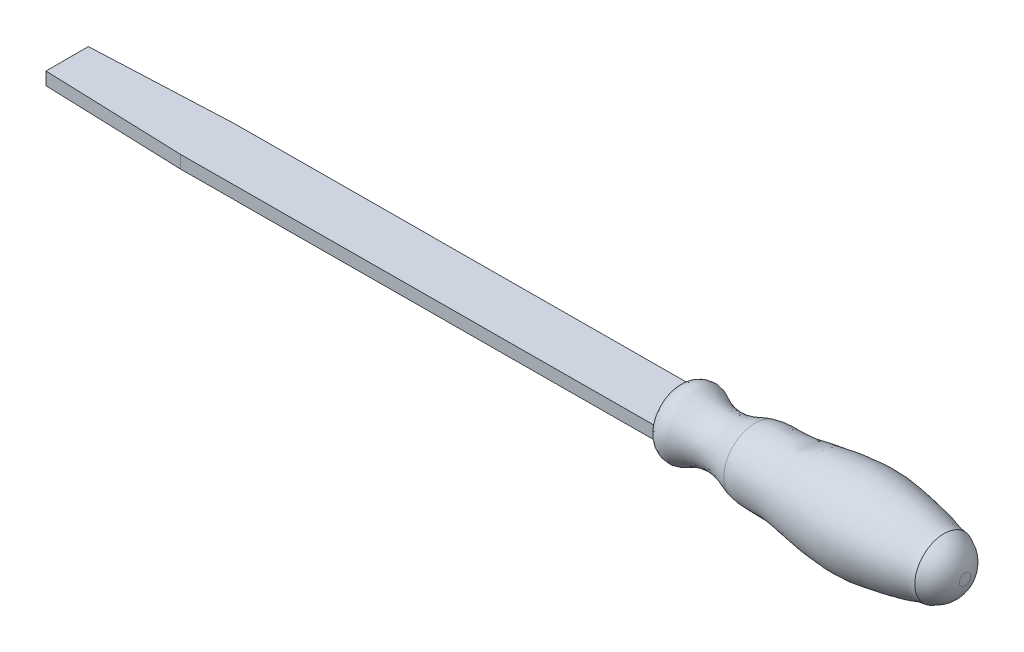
ISO-10303-21;
HEADER;
FILE_DESCRIPTION(('STEP AP214'),'2;1');
FILE_NAME('part.step','',(''),(''),'','','');
FILE_SCHEMA(('AUTOMOTIVE_DESIGN { 1 0 10303 214 1 1 1 1 }'));
ENDSEC;
DATA;
#1=APPLICATION_CONTEXT('core data for automotive mechanical design processes');
#2=APPLICATION_PROTOCOL_DEFINITION('international standard','automotive_design',2000,#1);
#3=PRODUCT_CONTEXT('',#1,'mechanical');
#4=PRODUCT('Part','Part','',(#3));
#5=PRODUCT_RELATED_PRODUCT_CATEGORY('part','',(#4));
#6=PRODUCT_DEFINITION_FORMATION('','',#4);
#7=PRODUCT_DEFINITION_CONTEXT('part definition',#1,'design');
#8=PRODUCT_DEFINITION('design','',#6,#7);
#9=PRODUCT_DEFINITION_SHAPE('','',#8);
#10=(LENGTH_UNIT() NAMED_UNIT(*) SI_UNIT(.MILLI.,.METRE.));
#11=(NAMED_UNIT(*) PLANE_ANGLE_UNIT() SI_UNIT($,.RADIAN.));
#12=(NAMED_UNIT(*) SI_UNIT($,.STERADIAN.) SOLID_ANGLE_UNIT());
#13=UNCERTAINTY_MEASURE_WITH_UNIT(LENGTH_MEASURE(1.E-05),#10,'distance_accuracy_value','');
#14=(GEOMETRIC_REPRESENTATION_CONTEXT(3) GLOBAL_UNCERTAINTY_ASSIGNED_CONTEXT((#13)) GLOBAL_UNIT_ASSIGNED_CONTEXT((#10,
#11,#12)) REPRESENTATION_CONTEXT('',''));
#15=CARTESIAN_POINT('',(0.,0.,0.));
#16=DIRECTION('',(0.,0.,1.));
#17=DIRECTION('',(1.,0.,0.));
#18=AXIS2_PLACEMENT_3D('',#15,#16,#17);
#19=CARTESIAN_POINT('',(-240.001553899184,-3.65954191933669,10.5));
#20=DIRECTION('',(0.00483121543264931,-0.999988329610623,0.));
#21=DIRECTION('',(0.999988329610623,0.00483121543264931,0.));
#22=AXIS2_PLACEMENT_3D('',#19,#20,#21);
#23=PLANE('',#22);
#24=DIRECTION('',(0.999988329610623,0.00483121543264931,0.));
#25=VECTOR('',#24,1.);
#26=CARTESIAN_POINT('',(-240.001553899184,-3.65954191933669,10.5));
#27=LINE('',#26,#25);
#28=CARTESIAN_POINT('',(-185.002195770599,-3.39382507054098,10.5));
#29=VERTEX_POINT('',#28);
#30=CARTESIAN_POINT('',(0.489100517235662,-2.49766619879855,10.5));
#31=VERTEX_POINT('',#30);
#32=EDGE_CURVE('E134',#29,#31,#27,.T.);
#33=ORIENTED_EDGE('',*,*,#32,.F.);
#34=DIRECTION('',(-0.999189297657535,-0.0048273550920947,-0.0399680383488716));
#35=VECTOR('',#34,1.);
#36=CARTESIAN_POINT('',(-239.913695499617,-3.65911745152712,8.30351437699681));
#37=LINE('',#36,#35);
#38=CARTESIAN_POINT('',(-240.001553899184,-3.65954191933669,8.3));
#39=VERTEX_POINT('',#38);
#40=EDGE_CURVE('E112',#29,#39,#37,.T.);
#41=ORIENTED_EDGE('',*,*,#40,.T.);
#42=DIRECTION('',(0.,0.,-1.));
#43=VECTOR('',#42,1.);
#44=CARTESIAN_POINT('',(-240.001553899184,-3.65954191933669,10.5));
#45=LINE('',#44,#43);
#46=CARTESIAN_POINT('',(-240.001553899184,-3.65954191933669,-8.29999999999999));
#47=VERTEX_POINT('',#46);
#48=EDGE_CURVE('E62',#39,#47,#45,.T.);
#49=ORIENTED_EDGE('',*,*,#48,.T.);
#50=DIRECTION('',(-0.999189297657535,-0.0048273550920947,0.0399680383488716));
#51=VECTOR('',#50,1.);
#52=CARTESIAN_POINT('',(-240.752343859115,-3.66316918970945,-8.26996805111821));
#53=LINE('',#52,#51);
#54=CARTESIAN_POINT('',(-185.002195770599,-3.39382507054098,-10.5));
#55=VERTEX_POINT('',#54);
#56=EDGE_CURVE('E412',#55,#47,#53,.T.);
#57=ORIENTED_EDGE('',*,*,#56,.F.);
#58=DIRECTION('',(0.999988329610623,0.00483121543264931,0.));
#59=VECTOR('',#58,1.);
#60=CARTESIAN_POINT('',(-240.001553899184,-3.65954191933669,-10.5));
#61=LINE('',#60,#59);
#62=CARTESIAN_POINT('',(0.489100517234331,-2.4976661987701,-10.5));
#63=VERTEX_POINT('',#62);
#64=EDGE_CURVE('E139',#55,#63,#61,.T.);
#65=ORIENTED_EDGE('',*,*,#64,.T.);
#66=CARTESIAN_POINT('',(0.489100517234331,-2.4976661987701,-10.5));
#67=CARTESIAN_POINT('',(0.430097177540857,-2.49795125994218,-10.1651251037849));
#68=CARTESIAN_POINT('',(0.376100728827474,-2.49821213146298,-9.8293716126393));
#69=CARTESIAN_POINT('',(0.278134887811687,-2.49868543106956,-9.15648477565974));
#70=CARTESIAN_POINT('',(0.234163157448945,-2.49889787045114,-8.81935177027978));
#71=CARTESIAN_POINT('',(0.156231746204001,-2.49927437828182,-8.14392027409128));
#72=CARTESIAN_POINT('',(0.122272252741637,-2.49943844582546,-7.80562176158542));
#73=CARTESIAN_POINT('',(0.0787450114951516,-2.4996487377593,-7.29752296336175));
#74=CARTESIAN_POINT('',(0.0654703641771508,-2.49971287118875,-7.1280322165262));
#75=CARTESIAN_POINT('',(0.0413619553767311,-2.4998293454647,-6.78887803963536));
#76=CARTESIAN_POINT('',(0.0305281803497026,-2.49988168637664,-6.61921461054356));
#77=CARTESIAN_POINT('',(0.00132719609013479,-2.50002276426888,-6.10465023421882));
#78=CARTESIAN_POINT('',(-0.0132821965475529,-2.50009334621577,-5.75953007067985));
#79=CARTESIAN_POINT('',(-0.0331181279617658,-2.50018917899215,-5.06898557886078));
#80=CARTESIAN_POINT('',(-0.0383434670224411,-2.50021442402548,-4.72356121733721));
#81=CARTESIAN_POINT('',(-0.0399355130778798,-2.50022211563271,-4.2054308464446));
#82=CARTESIAN_POINT('',(-0.0394253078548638,-2.5002196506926,-4.03272681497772));
#83=CARTESIAN_POINT('',(-0.0365448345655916,-2.50020573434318,-3.68733115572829));
#84=CARTESIAN_POINT('',(-0.0341745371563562,-2.50019428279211,-3.51463952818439));
#85=CARTESIAN_POINT('',(-0.0278556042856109,-2.50016375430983,-3.16933386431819));
#86=CARTESIAN_POINT('',(-0.0239073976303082,-2.5001446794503,-2.99671981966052));
#87=CARTESIAN_POINT('',(-0.0148737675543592,-2.50010103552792,-2.65152889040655));
#88=CARTESIAN_POINT('',(-0.00978839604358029,-2.50007646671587,-2.47895200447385));
#89=CARTESIAN_POINT('',(-0.00435479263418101,-2.50005021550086,-2.30638905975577));
#90=B_SPLINE_CURVE_WITH_KNOTS('',3,(#66,#67,#68,#69,#70,#71,#72,#73,#74,#75,#76,#77,#78,#79,#80,
#81,#82,#83,#84,#85,#86,#87,#88,#89),.UNSPECIFIED.,.F.,.F.,(4,2,2,2,2,2,2,2,2,2,2,4),(0.,
1.0200556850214,2.03987321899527,3.05970984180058,3.56972412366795,4.07973557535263,
5.11587551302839,6.1521479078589,6.67025372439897,7.18836771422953,7.70634099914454,
8.2242906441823),.UNSPECIFIED.);
#91=CARTESIAN_POINT('',(-0.00435479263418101,-2.50005021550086,-2.30638905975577));
#92=VERTEX_POINT('',#91);
#93=EDGE_CURVE('E189',#63,#92,#90,.T.);
#94=ORIENTED_EDGE('',*,*,#93,.T.);
#95=DIRECTION('',(0.,0.,-1.));
#96=VECTOR('',#95,1.);
#97=CARTESIAN_POINT('',(-0.004354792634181,-2.50005021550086,10.5));
#98=LINE('',#97,#96);
#99=CARTESIAN_POINT('',(-0.00435479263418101,-2.50005021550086,2.30638905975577));
#100=VERTEX_POINT('',#99);
#101=EDGE_CURVE('E263',#100,#92,#98,.T.);
#102=ORIENTED_EDGE('',*,*,#101,.F.);
#103=CARTESIAN_POINT('',(-0.00435479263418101,-2.50005021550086,2.30638905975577));
#104=CARTESIAN_POINT('',(-0.00971740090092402,-2.50007612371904,2.47672821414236));
#105=CARTESIAN_POINT('',(-0.0147419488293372,-2.50010039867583,2.64708083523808));
#106=CARTESIAN_POINT('',(-0.0236888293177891,-2.50014362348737,2.98782207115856));
#107=CARTESIAN_POINT('',(-0.0276111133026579,-2.50016257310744,3.15821068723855));
#108=CARTESIAN_POINT('',(-0.0339276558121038,-2.50019309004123,3.49906287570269));
#109=CARTESIAN_POINT('',(-0.0363215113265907,-2.50020465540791,3.66952645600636));
#110=CARTESIAN_POINT('',(-0.0393062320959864,-2.50021907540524,4.01046644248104));
#111=CARTESIAN_POINT('',(-0.0398971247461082,-2.50022193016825,4.1809428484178));
#112=CARTESIAN_POINT('',(-0.0386409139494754,-2.50021586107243,4.69239828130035));
#113=CARTESIAN_POINT('',(-0.0337643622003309,-2.50019230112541,5.03337717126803));
#114=CARTESIAN_POINT('',(-0.0148953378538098,-2.5001011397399,5.71504960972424));
#115=CARTESIAN_POINT('',(-0.000903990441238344,-2.50003354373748,6.05574318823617));
#116=CARTESIAN_POINT('',(0.0273968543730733,-2.49989681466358,6.56782957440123));
#117=CARTESIAN_POINT('',(0.0381104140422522,-2.4998450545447,6.73942652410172));
#118=CARTESIAN_POINT('',(0.0620305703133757,-2.49972948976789,7.08244740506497));
#119=CARTESIAN_POINT('',(0.0752371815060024,-2.49966568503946,7.25387133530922));
#120=CARTESIAN_POINT('',(0.118641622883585,-2.49945598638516,7.76776586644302));
#121=CARTESIAN_POINT('',(0.152627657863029,-2.49929179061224,8.10992480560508));
#122=CARTESIAN_POINT('',(0.230976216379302,-2.4989132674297,8.79426477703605));
#123=CARTESIAN_POINT('',(0.275374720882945,-2.49869876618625,9.13644167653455));
#124=CARTESIAN_POINT('',(0.374494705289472,-2.49821989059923,9.81938098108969));
#125=CARTESIAN_POINT('',(0.42921867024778,-2.4979555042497,10.1601430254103));
#126=CARTESIAN_POINT('',(0.489100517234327,-2.49766619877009,10.5));
#127=B_SPLINE_CURVE_WITH_KNOTS('',3,(#103,#104,#105,#106,#107,#108,#109,#110,#111,#112,#113,
#114,#115,#116,#117,#118,#119,#120,#121,#122,#123,#124,#125,#126),.UNSPECIFIED.,.F.,.F.,(4,2,2,
2,2,2,2,2,2,2,2,4),(0.,0.511274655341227,1.02257183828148,1.53400378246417,2.0454279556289,
3.06835535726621,4.09115650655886,4.60693364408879,5.1227138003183,6.15407710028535,
7.18905826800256,8.22428884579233),.UNSPECIFIED.);
#128=EDGE_CURVE('E175',#100,#31,#127,.T.);
#129=ORIENTED_EDGE('',*,*,#128,.T.);
#130=EDGE_LOOP('',(#33,#41,#49,#57,#65,#94,#102,#129));
#131=FACE_BOUND('',#130,.T.);
#132=ADVANCED_FACE('F39',(#131),#23,.T.);
#133=CARTESIAN_POINT('',(-240.001553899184,-3.65954191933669,10.5));
#134=DIRECTION('',(0.,0.,1.));
#135=DIRECTION('',(1.,0.,0.));
#136=AXIS2_PLACEMENT_3D('',#133,#134,#135);
#137=PLANE('',#136);
#138=DIRECTION('',(0.999988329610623,0.00483121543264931,0.));
#139=VECTOR('',#138,1.);
#140=CARTESIAN_POINT('',(-240.025709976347,1.34039972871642,10.5));
#141=LINE('',#140,#139);
#142=CARTESIAN_POINT('',(-185.026351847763,1.60611657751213,10.5));
#143=VERTEX_POINT('',#142);
#144=CARTESIAN_POINT('',(0.464944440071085,2.50227544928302,10.5));
#145=VERTEX_POINT('',#144);
#146=EDGE_CURVE('E122',#143,#145,#141,.T.);
#147=ORIENTED_EDGE('',*,*,#146,.F.);
#148=DIRECTION('',(-0.00483121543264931,0.999988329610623,0.));
#149=VECTOR('',#148,1.);
#150=CARTESIAN_POINT('',(-184.932325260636,-17.8559610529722,10.5));
#151=LINE('',#150,#149);
#152=EDGE_CURVE('E110',#29,#143,#151,.T.);
#153=ORIENTED_EDGE('',*,*,#152,.F.);
#154=ORIENTED_EDGE('',*,*,#32,.T.);
#155=CARTESIAN_POINT('',(0.490778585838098,-2.53329701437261,10.5));
#156=CARTESIAN_POINT('',(0.480146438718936,-2.30895754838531,10.5));
#157=CARTESIAN_POINT('',(0.470832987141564,-2.08455639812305,10.5));
#158=CARTESIAN_POINT('',(0.454785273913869,-1.63574691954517,10.5));
#159=CARTESIAN_POINT('',(0.44805003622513,-1.41133862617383,10.5));
#160=CARTESIAN_POINT('',(0.437093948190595,-0.962516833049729,10.5));
#161=CARTESIAN_POINT('',(0.432872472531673,-0.738103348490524,10.5));
#162=CARTESIAN_POINT('',(0.426909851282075,-0.28927167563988,10.5));
#163=CARTESIAN_POINT('',(0.425168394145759,-0.064853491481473,10.5));
#164=CARTESIAN_POINT('',(0.424157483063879,0.383988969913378,10.5));
#165=CARTESIAN_POINT('',(0.424888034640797,0.608413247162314,10.5));
#166=CARTESIAN_POINT('',(0.428841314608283,1.05726773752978,10.5));
#167=CARTESIAN_POINT('',(0.432064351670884,1.28169794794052,10.5));
#168=CARTESIAN_POINT('',(0.441047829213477,1.73056374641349,10.5));
#169=CARTESIAN_POINT('',(0.446808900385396,1.95499932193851,10.5));
#170=CARTESIAN_POINT('',(0.460942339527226,2.40387392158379,10.5));
#171=CARTESIAN_POINT('',(0.469315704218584,2.62831291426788,10.5));
#172=CARTESIAN_POINT('',(0.479029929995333,2.85269480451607,10.5));
#173=B_SPLINE_CURVE_WITH_KNOTS('',3,(#155,#156,#157,#158,#159,#160,#161,#162,#163,#164,#165,
#166,#167,#168,#169,#170,#171,#172),.UNSPECIFIED.,.F.,.F.,(4,2,2,2,2,2,2,2,4),(0.,
0.673768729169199,1.34728213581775,2.02062793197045,2.69388913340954,3.36715183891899,
4.04049793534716,4.71401145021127,5.38778225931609),.UNSPECIFIED.);
#174=EDGE_CURVE('E132',#31,#145,#173,.T.);
#175=ORIENTED_EDGE('',*,*,#174,.T.);
#176=EDGE_LOOP('',(#147,#153,#154,#175));
#177=FACE_BOUND('',#176,.T.);
#178=ADVANCED_FACE('F130',(#177),#137,.T.);
#179=CARTESIAN_POINT('',(-240.025709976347,1.34039972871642,10.5));
#180=DIRECTION('',(-0.00483121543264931,0.999988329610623,0.));
#181=DIRECTION('',(-0.999988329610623,-0.00483121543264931,0.));
#182=AXIS2_PLACEMENT_3D('',#179,#180,#181);
#183=PLANE('',#182);
#184=DIRECTION('',(0.,0.,1.));
#185=VECTOR('',#184,1.);
#186=CARTESIAN_POINT('',(-240.025709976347,1.34039972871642,10.5));
#187=LINE('',#186,#185);
#188=CARTESIAN_POINT('',(-240.025709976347,1.34039972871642,-8.3));
#189=VERTEX_POINT('',#188);
#190=CARTESIAN_POINT('',(-240.025709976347,1.34039972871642,8.3));
#191=VERTEX_POINT('',#190);
#192=EDGE_CURVE('E126',#189,#191,#187,.T.);
#193=ORIENTED_EDGE('',*,*,#192,.T.);
#194=DIRECTION('',(0.999189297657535,0.0048273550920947,0.0399680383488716));
#195=VECTOR('',#194,1.);
#196=CARTESIAN_POINT('',(-240.025709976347,1.34039972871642,8.3));
#197=LINE('',#196,#195);
#198=EDGE_CURVE('E55',#191,#143,#197,.T.);
#199=ORIENTED_EDGE('',*,*,#198,.T.);
#200=ORIENTED_EDGE('',*,*,#146,.T.);
#201=CARTESIAN_POINT('',(0.464944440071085,2.50227544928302,10.5));
#202=CARTESIAN_POINT('',(0.405941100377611,2.50199038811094,10.1651251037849));
#203=CARTESIAN_POINT('',(0.351944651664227,2.50172951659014,9.8293716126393));
#204=CARTESIAN_POINT('',(0.253978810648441,2.50125621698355,9.15648477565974));
#205=CARTESIAN_POINT('',(0.210007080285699,2.50104377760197,8.81935177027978));
#206=CARTESIAN_POINT('',(0.132075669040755,2.50066726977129,8.14392027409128));
#207=CARTESIAN_POINT('',(0.0981161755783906,2.50050320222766,7.80562176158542));
#208=CARTESIAN_POINT('',(0.0545889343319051,2.50029291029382,7.29752296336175));
#209=CARTESIAN_POINT('',(0.0413142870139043,2.50022877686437,7.1280322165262));
#210=CARTESIAN_POINT('',(0.0172058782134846,2.50011230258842,6.78887803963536));
#211=CARTESIAN_POINT('',(0.00637210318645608,2.50005996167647,6.61921461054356));
#212=CARTESIAN_POINT('',(-0.0228288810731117,2.49991888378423,6.10465023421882));
#213=CARTESIAN_POINT('',(-0.0374382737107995,2.49984830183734,5.75953007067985));
#214=CARTESIAN_POINT('',(-0.0572742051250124,2.49975246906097,5.06898557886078));
#215=CARTESIAN_POINT('',(-0.0624995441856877,2.49972722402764,4.72356121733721));
#216=CARTESIAN_POINT('',(-0.0640915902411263,2.4997195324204,4.2054308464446));
#217=CARTESIAN_POINT('',(-0.0635813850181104,2.49972199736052,4.03272681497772));
#218=CARTESIAN_POINT('',(-0.0607009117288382,2.49973591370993,3.68733115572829));
#219=CARTESIAN_POINT('',(-0.0583306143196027,2.499747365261,3.51463952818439));
#220=CARTESIAN_POINT('',(-0.0520116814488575,2.49977789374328,3.16933386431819));
#221=CARTESIAN_POINT('',(-0.0480634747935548,2.49979696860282,2.99671981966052));
#222=CARTESIAN_POINT('',(-0.0390298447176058,2.4998406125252,2.65152889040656));
#223=CARTESIAN_POINT('',(-0.0339444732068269,2.49986518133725,2.47895200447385));
#224=CARTESIAN_POINT('',(-0.0285108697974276,2.49989143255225,2.30638905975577));
#225=B_SPLINE_CURVE_WITH_KNOTS('',3,(#201,#202,#203,#204,#205,#206,#207,#208,#209,#210,#211,
#212,#213,#214,#215,#216,#217,#218,#219,#220,#221,#222,#223,#224),.UNSPECIFIED.,.F.,.F.,(4,2,2,
2,2,2,2,2,2,2,2,4),(0.,1.0200556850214,2.03987321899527,3.05970984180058,3.56972412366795,
4.07973557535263,5.11587551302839,6.1521479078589,6.67025372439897,7.18836771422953,
7.70634099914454,8.2242906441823),.UNSPECIFIED.);
#226=CARTESIAN_POINT('',(-0.0285108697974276,2.49989143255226,2.30638905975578));
#227=VERTEX_POINT('',#226);
#228=EDGE_CURVE('E165',#145,#227,#225,.T.);
#229=ORIENTED_EDGE('',*,*,#228,.T.);
#230=DIRECTION('',(0.,0.,1.));
#231=VECTOR('',#230,1.);
#232=CARTESIAN_POINT('',(-0.0285108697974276,2.49989143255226,10.5));
#233=LINE('',#232,#231);
#234=CARTESIAN_POINT('',(-0.0285108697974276,2.49989143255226,-2.30638905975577));
#235=VERTEX_POINT('',#234);
#236=EDGE_CURVE('E269',#235,#227,#233,.T.);
#237=ORIENTED_EDGE('',*,*,#236,.F.);
#238=CARTESIAN_POINT('',(-0.0285108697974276,2.49989143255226,-2.30638905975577));
#239=CARTESIAN_POINT('',(-0.0338734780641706,2.49986552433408,-2.47672821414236));
#240=CARTESIAN_POINT('',(-0.0388980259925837,2.49984124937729,-2.64708083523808));
#241=CARTESIAN_POINT('',(-0.0478449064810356,2.49979802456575,-2.98782207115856));
#242=CARTESIAN_POINT('',(-0.0517671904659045,2.49977907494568,-3.15821068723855));
#243=CARTESIAN_POINT('',(-0.0580837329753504,2.49974855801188,-3.49906287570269));
#244=CARTESIAN_POINT('',(-0.0604775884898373,2.4997369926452,-3.66952645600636));
#245=CARTESIAN_POINT('',(-0.063462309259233,2.49972257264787,-4.01046644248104));
#246=CARTESIAN_POINT('',(-0.0640532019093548,2.49971971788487,-4.1809428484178));
#247=CARTESIAN_POINT('',(-0.062796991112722,2.49972578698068,-4.69239828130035));
#248=CARTESIAN_POINT('',(-0.0579204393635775,2.4997493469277,-5.03337717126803));
#249=CARTESIAN_POINT('',(-0.0390514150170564,2.49984050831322,-5.71504960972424));
#250=CARTESIAN_POINT('',(-0.0250600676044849,2.49990810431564,-6.05574318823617));
#251=CARTESIAN_POINT('',(0.00324077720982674,2.50004483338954,-6.56782957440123));
#252=CARTESIAN_POINT('',(0.0139543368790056,2.50009659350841,-6.73942652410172));
#253=CARTESIAN_POINT('',(0.0378744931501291,2.50021215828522,-7.08244740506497));
#254=CARTESIAN_POINT('',(0.0510811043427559,2.50027596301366,-7.25387133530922));
#255=CARTESIAN_POINT('',(0.0944855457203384,2.50048566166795,-7.76776586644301));
#256=CARTESIAN_POINT('',(0.128471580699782,2.50064985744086,-8.10992480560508));
#257=CARTESIAN_POINT('',(0.206820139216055,2.50102838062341,-8.79426477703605));
#258=CARTESIAN_POINT('',(0.251218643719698,2.50124288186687,-9.13644167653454));
#259=CARTESIAN_POINT('',(0.350338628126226,2.50172175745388,-9.81938098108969));
#260=CARTESIAN_POINT('',(0.405062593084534,2.50198614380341,-10.1601430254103));
#261=CARTESIAN_POINT('',(0.46494444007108,2.50227544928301,-10.5));
#262=B_SPLINE_CURVE_WITH_KNOTS('',3,(#238,#239,#240,#241,#242,#243,#244,#245,#246,#247,#248,
#249,#250,#251,#252,#253,#254,#255,#256,#257,#258,#259,#260,#261),.UNSPECIFIED.,.F.,.F.,(4,2,2,
2,2,2,2,2,2,2,2,4),(0.,0.511274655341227,1.02257183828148,1.53400378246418,2.0454279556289,
3.06835535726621,4.09115650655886,4.60693364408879,5.1227138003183,6.15407710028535,
7.18905826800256,8.22428884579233),.UNSPECIFIED.);
#263=CARTESIAN_POINT('',(0.464944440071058,2.50227544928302,-10.5));
#264=VERTEX_POINT('',#263);
#265=EDGE_CURVE('E182',#235,#264,#262,.T.);
#266=ORIENTED_EDGE('',*,*,#265,.T.);
#267=DIRECTION('',(0.999988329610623,0.00483121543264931,0.));
#268=VECTOR('',#267,1.);
#269=CARTESIAN_POINT('',(-240.025709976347,1.34039972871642,-10.5));
#270=LINE('',#269,#268);
#271=CARTESIAN_POINT('',(-185.026351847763,1.60611657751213,-10.5));
#272=VERTEX_POINT('',#271);
#273=EDGE_CURVE('E135',#272,#264,#270,.T.);
#274=ORIENTED_EDGE('',*,*,#273,.F.);
#275=DIRECTION('',(0.999189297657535,0.0048273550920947,-0.0399680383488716));
#276=VECTOR('',#275,1.);
#277=CARTESIAN_POINT('',(-240.025709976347,1.34039972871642,-8.3));
#278=LINE('',#277,#276);
#279=EDGE_CURVE('E426',#189,#272,#278,.T.);
#280=ORIENTED_EDGE('',*,*,#279,.F.);
#281=EDGE_LOOP('',(#193,#199,#200,#229,#237,#266,#274,#280));
#282=FACE_BOUND('',#281,.T.);
#283=ADVANCED_FACE('F120',(#282),#183,.T.);
#284=CARTESIAN_POINT('',(-240.013631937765,-1.15957109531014,0.));
#285=DIRECTION('',(-0.999988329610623,-0.00483121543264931,0.));
#286=DIRECTION('',(0.00483121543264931,-0.999988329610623,0.));
#287=AXIS2_PLACEMENT_3D('',#284,#285,#286);
#288=PLANE('',#287);
#289=ORIENTED_EDGE('',*,*,#48,.F.);
#290=DIRECTION('',(-0.00483121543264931,0.999988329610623,0.));
#291=VECTOR('',#290,1.);
#292=CARTESIAN_POINT('',(-240.013631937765,-1.15957109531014,8.3));
#293=LINE('',#292,#291);
#294=EDGE_CURVE('E11',#39,#191,#293,.T.);
#295=ORIENTED_EDGE('',*,*,#294,.T.);
#296=ORIENTED_EDGE('',*,*,#192,.F.);
#297=DIRECTION('',(-0.00483121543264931,0.999988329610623,0.));
#298=VECTOR('',#297,1.);
#299=CARTESIAN_POINT('',(-240.013631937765,-1.15957109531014,-8.3));
#300=LINE('',#299,#298);
#301=EDGE_CURVE('E48',#47,#189,#300,.T.);
#302=ORIENTED_EDGE('',*,*,#301,.F.);
#303=EDGE_LOOP('',(#289,#295,#296,#302));
#304=FACE_BOUND('',#303,.T.);
#305=ADVANCED_FACE('F198',(#304),#288,.T.);
#306=CARTESIAN_POINT('',(0.,0.,0.));
#307=DIRECTION('',(-0.999988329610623,-0.00483121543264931,0.));
#308=DIRECTION('',(0.00483121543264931,-0.999988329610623,0.));
#309=AXIS2_PLACEMENT_3D('',#306,#307,#308);
#310=CONICAL_SURFACE('',#309,0.,1.5659650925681);
#311=CARTESIAN_POINT('',(-0.0164328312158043,-7.93914743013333E-05,0.));
#312=DIRECTION('',(-0.999988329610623,-0.00483121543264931,0.));
#313=DIRECTION('',(0.00483121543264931,-0.999988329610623,0.));
#314=AXIS2_PLACEMENT_3D('',#311,#312,#313);
#315=CIRCLE('',#314,3.40138655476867);
#316=EDGE_CURVE('E239',#100,#227,#315,.T.);
#317=ORIENTED_EDGE('',*,*,#316,.T.);
#318=EDGE_CURVE('E241',#227,#235,#315,.T.);
#319=ORIENTED_EDGE('',*,*,#318,.T.);
#320=EDGE_CURVE('E249',#235,#92,#315,.T.);
#321=ORIENTED_EDGE('',*,*,#320,.T.);
#322=EDGE_CURVE('E238',#92,#100,#315,.T.);
#323=ORIENTED_EDGE('',*,*,#322,.T.);
#324=EDGE_LOOP('',(#317,#319,#321,#323));
#325=FACE_BOUND('',#324,.T.);
#326=CARTESIAN_POINT('',(0.,0.,0.));
#327=VERTEX_POINT('',#326);
#328=VERTEX_LOOP('',#327);
#329=FACE_BOUND('',#328,.T.);
#330=ADVANCED_FACE('F41',(#325,#329),#310,.F.);
#331=CARTESIAN_POINT('',(0.,-3.40142625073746,0.));
#332=CARTESIAN_POINT('',(-0.15562647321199,-7.16439135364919,0.));
#333=CARTESIAN_POINT('',(0.545364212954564,-10.8774958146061,0.));
#334=B_SPLINE_CURVE_WITH_KNOTS('',2,(#331,#332,#333),.UNSPECIFIED.,.F.,.F.,(3,3),(0.,1.),.UNSPECIFIED.);
#335=CARTESIAN_POINT('',(0.,0.,0.));
#336=DIRECTION('',(-0.999988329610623,-0.00483121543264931,0.));
#337=AXIS1_PLACEMENT('',#335,#336);
#338=SURFACE_OF_REVOLUTION('',#334,#337);
#339=ORIENTED_EDGE('',*,*,#93,.F.);
#340=CARTESIAN_POINT('',(0.479029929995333,2.85269480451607,-10.5));
#341=CARTESIAN_POINT('',(0.469315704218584,2.62831291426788,-10.5));
#342=CARTESIAN_POINT('',(0.460942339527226,2.40387392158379,-10.5));
#343=CARTESIAN_POINT('',(0.446808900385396,1.95499932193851,-10.5));
#344=CARTESIAN_POINT('',(0.441047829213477,1.7305637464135,-10.5));
#345=CARTESIAN_POINT('',(0.432064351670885,1.28169794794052,-10.5));
#346=CARTESIAN_POINT('',(0.428841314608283,1.05726773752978,-10.5));
#347=CARTESIAN_POINT('',(0.424888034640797,0.608413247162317,-10.5));
#348=CARTESIAN_POINT('',(0.424157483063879,0.383988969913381,-10.5));
#349=CARTESIAN_POINT('',(0.425168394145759,-0.0648534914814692,-10.5));
#350=CARTESIAN_POINT('',(0.426909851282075,-0.289271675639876,-10.5));
#351=CARTESIAN_POINT('',(0.432872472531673,-0.73810334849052,-10.5));
#352=CARTESIAN_POINT('',(0.437093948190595,-0.962516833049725,-10.5));
#353=CARTESIAN_POINT('',(0.44805003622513,-1.41133862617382,-10.5));
#354=CARTESIAN_POINT('',(0.454785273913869,-1.63574691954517,-10.5));
#355=CARTESIAN_POINT('',(0.470832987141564,-2.08455639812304,-10.5));
#356=CARTESIAN_POINT('',(0.480146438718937,-2.30895754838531,-10.5));
#357=CARTESIAN_POINT('',(0.490778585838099,-2.5332970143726,-10.5));
#358=B_SPLINE_CURVE_WITH_KNOTS('',3,(#340,#341,#342,#343,#344,#345,#346,#347,#348,#349,#350,
#351,#352,#353,#354,#355,#356,#357),.UNSPECIFIED.,.F.,.F.,(4,2,2,2,2,2,2,2,4),(0.,
0.673770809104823,1.34728432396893,2.0206304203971,2.69389312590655,3.36715432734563,
4.04050012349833,4.71401353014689,5.38778225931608),.UNSPECIFIED.);
#359=EDGE_CURVE('E406',#264,#63,#358,.T.);
#360=ORIENTED_EDGE('',*,*,#359,.F.);
#361=ORIENTED_EDGE('',*,*,#265,.F.);
#362=ORIENTED_EDGE('',*,*,#318,.F.);
#363=ORIENTED_EDGE('',*,*,#228,.F.);
#364=ORIENTED_EDGE('',*,*,#174,.F.);
#365=ORIENTED_EDGE('',*,*,#128,.F.);
#366=ORIENTED_EDGE('',*,*,#322,.F.);
#367=EDGE_LOOP('',(#339,#360,#361,#362,#363,#364,#365,#366));
#368=FACE_BOUND('',#367,.T.);
#369=CARTESIAN_POINT('',(0.49280057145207,0.00238085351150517,0.));
#370=DIRECTION('',(-0.999988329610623,-0.00483121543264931,0.));
#371=DIRECTION('',(0.00483121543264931,-0.999988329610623,0.));
#372=AXIS2_PLACEMENT_3D('',#369,#370,#371);
#373=CIRCLE('',#372,10.8800036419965);
#374=CARTESIAN_POINT('',(0.545364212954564,-10.8774958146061,0.));
#375=VERTEX_POINT('',#374);
#376=EDGE_CURVE('E235',#375,#375,#373,.T.);
#377=ORIENTED_EDGE('',*,*,#376,.T.);
#378=EDGE_LOOP('',(#377));
#379=FACE_BOUND('',#378,.T.);
#380=ADVANCED_FACE('F155',(#368,#379),#338,.F.);
#381=CARTESIAN_POINT('',(0.545364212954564,-10.8774958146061,0.));
#382=CARTESIAN_POINT('',(1.37034871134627,-11.9743869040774,0.));
#383=CARTESIAN_POINT('',(3.32259956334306,-12.8302408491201,0.));
#384=CARTESIAN_POINT('',(6.19462989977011,-12.9244191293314,0.));
#385=CARTESIAN_POINT('',(8.21729207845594,-11.8858709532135,0.));
#386=CARTESIAN_POINT('',(10.5136735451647,-10.6744661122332,0.));
#387=CARTESIAN_POINT('',(13.281514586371,-9.80869703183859,0.));
#388=CARTESIAN_POINT('',(16.6319516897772,-9.22347666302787,0.));
#389=CARTESIAN_POINT('',(20.2629187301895,-9.32596056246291,0.));
#390=CARTESIAN_POINT('',(24.1568373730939,-10.1633752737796,0.));
#391=CARTESIAN_POINT('',(27.1905964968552,-11.558728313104,0.));
#392=CARTESIAN_POINT('',(29.1632772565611,-12.0599366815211,0.));
#393=CARTESIAN_POINT('',(29.7779090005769,-12.2061348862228,0.));
#394=B_SPLINE_CURVE_WITH_KNOTS('',3,(#381,#382,#383,#384,#385,#386,#387,#388,#389,#390,#391,
#392,#393),.UNSPECIFIED.,.F.,.F.,(4,1,1,1,1,1,1,1,1,1,4),(0.,0.120356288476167,
0.182103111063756,0.252493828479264,0.320379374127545,0.416926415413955,0.511670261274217,
0.625759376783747,0.741661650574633,0.867963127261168,0.924773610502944),.UNSPECIFIED.);
#395=CARTESIAN_POINT('',(0.,0.,0.));
#396=DIRECTION('',(-0.999988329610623,-0.00483121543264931,0.));
#397=AXIS1_PLACEMENT('',#395,#396);
#398=SURFACE_OF_REVOLUTION('',#394,#397);
#399=CARTESIAN_POINT('',(29.7182441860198,0.143576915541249,0.));
#400=DIRECTION('',(-0.999988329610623,-0.00483121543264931,0.));
#401=DIRECTION('',(0.00483121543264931,-0.999988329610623,0.));
#402=AXIS2_PLACEMENT_3D('',#399,#400,#401);
#403=CIRCLE('',#402,12.3498559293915);
#404=CARTESIAN_POINT('',(29.7779090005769,-12.2061348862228,0.));
#405=VERTEX_POINT('',#404);
#406=EDGE_CURVE('E231',#405,#405,#403,.T.);
#407=ORIENTED_EDGE('',*,*,#406,.T.);
#408=EDGE_LOOP('',(#407));
#409=FACE_BOUND('',#408,.T.);
#410=ORIENTED_EDGE('',*,*,#376,.F.);
#411=EDGE_LOOP('',(#410));
#412=FACE_BOUND('',#411,.T.);
#413=ADVANCED_FACE('F159',(#409,#412),#398,.F.);
#414=CARTESIAN_POINT('',(29.7779090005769,-12.2061348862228,0.));
#415=CARTESIAN_POINT('',(31.1346179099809,-12.4503532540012,0.));
#416=CARTESIAN_POINT('',(33.1675652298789,-12.8911490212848,0.));
#417=CARTESIAN_POINT('',(36.3876480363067,-12.9050924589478,0.));
#418=CARTESIAN_POINT('',(39.1715363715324,-12.8798778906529,0.));
#419=CARTESIAN_POINT('',(42.6259033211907,-12.9791040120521,0.));
#420=CARTESIAN_POINT('',(46.2180468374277,-13.3469629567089,0.));
#421=CARTESIAN_POINT('',(49.9167304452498,-14.0067787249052,0.));
#422=CARTESIAN_POINT('',(53.6218083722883,-14.6404916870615,0.));
#423=CARTESIAN_POINT('',(57.2661896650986,-15.1744291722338,0.));
#424=CARTESIAN_POINT('',(61.1201600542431,-15.6812353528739,0.));
#425=CARTESIAN_POINT('',(65.1405088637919,-15.9976015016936,0.));
#426=CARTESIAN_POINT('',(69.2720383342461,-16.4213874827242,0.));
#427=CARTESIAN_POINT('',(73.6065603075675,-16.3521229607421,0.));
#428=CARTESIAN_POINT('',(77.7838995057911,-16.2161925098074,0.));
#429=CARTESIAN_POINT('',(81.9902090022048,-15.5315842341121,0.));
#430=CARTESIAN_POINT('',(86.3140591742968,-14.8039570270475,0.));
#431=CARTESIAN_POINT('',(91.8474270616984,-13.8515046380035,0.));
#432=CARTESIAN_POINT('',(97.7508899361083,-12.5390196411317,0.));
#433=CARTESIAN_POINT('',(101.929439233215,-10.9603572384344,0.));
#434=CARTESIAN_POINT('',(103.818425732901,-10.9881922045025,0.));
#435=B_SPLINE_CURVE_WITH_KNOTS('',3,(#414,#415,#416,#417,#418,#419,#420,#421,#422,#423,#424,
#425,#426,#427,#428,#429,#430,#431,#432,#433,#434),.UNSPECIFIED.,.F.,.F.,(4,1,1,1,1,1,1,1,1,1,1,
1,1,1,1,1,1,1,4),(0.,0.0553981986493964,0.0826774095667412,0.128818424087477,0.167035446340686,
0.221096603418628,0.273333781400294,0.317568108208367,0.371733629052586,0.420941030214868,
0.473294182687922,0.533363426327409,0.587167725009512,0.646878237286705,0.700631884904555,
0.757710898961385,0.822668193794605,0.92558882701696,1.),.UNSPECIFIED.);
#436=CARTESIAN_POINT('',(0.,0.,0.));
#437=DIRECTION('',(-0.999988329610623,-0.00483121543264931,0.));
#438=AXIS1_PLACEMENT('',#436,#437);
#439=SURFACE_OF_REVOLUTION('',#435,#438);
#440=CARTESIAN_POINT('',(103.762916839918,0.501306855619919,0.));
#441=DIRECTION('',(-0.999988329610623,-0.00483121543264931,0.));
#442=DIRECTION('',(0.00483121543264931,-0.999988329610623,0.));
#443=AXIS2_PLACEMENT_3D('',#440,#441,#442);
#444=CIRCLE('',#443,11.489633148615);
#445=CARTESIAN_POINT('',(103.818425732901,-10.9881922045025,0.));
#446=VERTEX_POINT('',#445);
#447=EDGE_CURVE('E227',#446,#446,#444,.T.);
#448=ORIENTED_EDGE('',*,*,#447,.T.);
#449=EDGE_LOOP('',(#448));
#450=FACE_BOUND('',#449,.T.);
#451=ORIENTED_EDGE('',*,*,#406,.F.);
#452=EDGE_LOOP('',(#451));
#453=FACE_BOUND('',#452,.T.);
#454=ADVANCED_FACE('F338',(#450,#453),#439,.F.);
#455=CARTESIAN_POINT('',(103.818425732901,-10.9881922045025,0.));
#456=CARTESIAN_POINT('',(105.386632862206,-10.3955734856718,0.));
#457=CARTESIAN_POINT('',(109.210159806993,-8.22697266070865,0.));
#458=CARTESIAN_POINT('',(111.462986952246,-4.23080075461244,0.));
#459=CARTESIAN_POINT('',(111.922279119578,-1.65220556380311,0.));
#460=B_SPLINE_CURVE_WITH_KNOTS('',3,(#455,#456,#457,#458,#459),.UNSPECIFIED.,.F.,.F.,(4,1,4),
(0.,0.39082533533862,1.),.UNSPECIFIED.);
#461=CARTESIAN_POINT('',(0.,0.,0.));
#462=DIRECTION('',(-0.999988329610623,-0.00483121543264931,0.));
#463=AXIS1_PLACEMENT('',#461,#462);
#464=SURFACE_OF_REVOLUTION('',#460,#463);
#465=CARTESIAN_POINT('',(111.911684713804,0.540675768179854,0.));
#466=DIRECTION('',(-0.999988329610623,-0.00483121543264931,0.));
#467=DIRECTION('',(0.00483121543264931,-0.999988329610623,0.));
#468=AXIS2_PLACEMENT_3D('',#465,#466,#467);
#469=CIRCLE('',#468,2.19290692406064);
#470=CARTESIAN_POINT('',(111.922279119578,-1.65220556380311,0.));
#471=VERTEX_POINT('',#470);
#472=EDGE_CURVE('E220',#471,#471,#469,.T.);
#473=ORIENTED_EDGE('',*,*,#472,.T.);
#474=EDGE_LOOP('',(#473));
#475=FACE_BOUND('',#474,.T.);
#476=ORIENTED_EDGE('',*,*,#447,.F.);
#477=EDGE_LOOP('',(#476));
#478=FACE_BOUND('',#477,.T.);
#479=ADVANCED_FACE('F210',(#475,#478),#464,.F.);
#480=CARTESIAN_POINT('',(111.922279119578,-1.65220556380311,0.));
#481=CARTESIAN_POINT('',(112.005297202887,-0.555338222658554,0.));
#482=CARTESIAN_POINT('',(112.,0.541102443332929,0.));
#483=B_SPLINE_CURVE_WITH_KNOTS('',2,(#480,#481,#482),.UNSPECIFIED.,.F.,.F.,(3,3),(0.5,1.),.UNSPECIFIED.);
#484=CARTESIAN_POINT('',(0.,0.,0.));
#485=DIRECTION('',(-0.999988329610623,-0.00483121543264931,0.));
#486=AXIS1_PLACEMENT('',#484,#485);
#487=SURFACE_OF_REVOLUTION('',#483,#486);
#488=CARTESIAN_POINT('',(112.,0.541102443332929,0.));
#489=VERTEX_POINT('',#488);
#490=VERTEX_LOOP('',#489);
#491=FACE_BOUND('',#490,.T.);
#492=ORIENTED_EDGE('',*,*,#472,.F.);
#493=EDGE_LOOP('',(#492));
#494=FACE_BOUND('',#493,.T.);
#495=ADVANCED_FACE('F206',(#491,#494),#487,.F.);
#496=CARTESIAN_POINT('',(-0.0164328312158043,-7.93914743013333E-05,0.));
#497=DIRECTION('',(-0.999988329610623,-0.00483121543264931,0.));
#498=DIRECTION('',(0.00483121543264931,-0.999988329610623,0.));
#499=AXIS2_PLACEMENT_3D('',#496,#497,#498);
#500=PLANE('',#499);
#501=ORIENTED_EDGE('',*,*,#316,.F.);
#502=ORIENTED_EDGE('',*,*,#101,.T.);
#503=ORIENTED_EDGE('',*,*,#320,.F.);
#504=ORIENTED_EDGE('',*,*,#236,.T.);
#505=EDGE_LOOP('',(#501,#502,#503,#504));
#506=FACE_BOUND('',#505,.T.);
#507=ADVANCED_FACE('F204',(#506),#500,.F.);
#508=CARTESIAN_POINT('',(-240.001553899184,-3.65954191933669,-10.5));
#509=DIRECTION('',(0.,0.,-1.));
#510=DIRECTION('',(-1.,0.,0.));
#511=AXIS2_PLACEMENT_3D('',#508,#509,#510);
#512=PLANE('',#511);
#513=DIRECTION('',(-0.00483121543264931,0.999988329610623,0.));
#514=VECTOR('',#513,1.);
#515=CARTESIAN_POINT('',(-184.932325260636,-17.8559610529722,-10.5));
#516=LINE('',#515,#514);
#517=EDGE_CURVE('E422',#55,#272,#516,.T.);
#518=ORIENTED_EDGE('',*,*,#517,.T.);
#519=ORIENTED_EDGE('',*,*,#273,.T.);
#520=ORIENTED_EDGE('',*,*,#359,.T.);
#521=ORIENTED_EDGE('',*,*,#64,.F.);
#522=EDGE_LOOP('',(#518,#519,#520,#521));
#523=FACE_BOUND('',#522,.T.);
#524=ADVANCED_FACE('F199',(#523),#512,.T.);
#525=CARTESIAN_POINT('',(-239.93168338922,-18.1216779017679,-8.3));
#526=DIRECTION('',(0.0399675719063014,0.000193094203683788,0.999200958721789));
#527=DIRECTION('',(0.999200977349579,0.,-0.0399675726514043));
#528=AXIS2_PLACEMENT_3D('',#525,#526,#527);
#529=PLANE('',#528);
#530=ORIENTED_EDGE('',*,*,#56,.T.);
#531=ORIENTED_EDGE('',*,*,#301,.T.);
#532=ORIENTED_EDGE('',*,*,#279,.T.);
#533=ORIENTED_EDGE('',*,*,#517,.F.);
#534=EDGE_LOOP('',(#530,#531,#532,#533));
#535=FACE_BOUND('',#534,.T.);
#536=ADVANCED_FACE('F203',(#535),#529,.F.);
#537=CARTESIAN_POINT('',(-239.93168338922,-18.1216779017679,8.3));
#538=DIRECTION('',(-0.0399675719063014,-0.000193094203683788,0.999200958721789));
#539=DIRECTION('',(0.999200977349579,0.,0.0399675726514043));
#540=AXIS2_PLACEMENT_3D('',#537,#538,#539);
#541=PLANE('',#540);
#542=ORIENTED_EDGE('',*,*,#152,.T.);
#543=ORIENTED_EDGE('',*,*,#198,.F.);
#544=ORIENTED_EDGE('',*,*,#294,.F.);
#545=ORIENTED_EDGE('',*,*,#40,.F.);
#546=EDGE_LOOP('',(#542,#543,#544,#545));
#547=FACE_BOUND('',#546,.T.);
#548=ADVANCED_FACE('F111',(#547),#541,.T.);
#549=CLOSED_SHELL('',(#132,#178,#283,#305,#330,#380,#413,#454,#479,#495,#507,#524,#536,#548));
#550=MANIFOLD_SOLID_BREP('B2',#549);
#551=ADVANCED_BREP_SHAPE_REPRESENTATION('',(#18,#550),#14);
#552=SHAPE_DEFINITION_REPRESENTATION(#9,#551);
ENDSEC;
END-ISO-10303-21;
